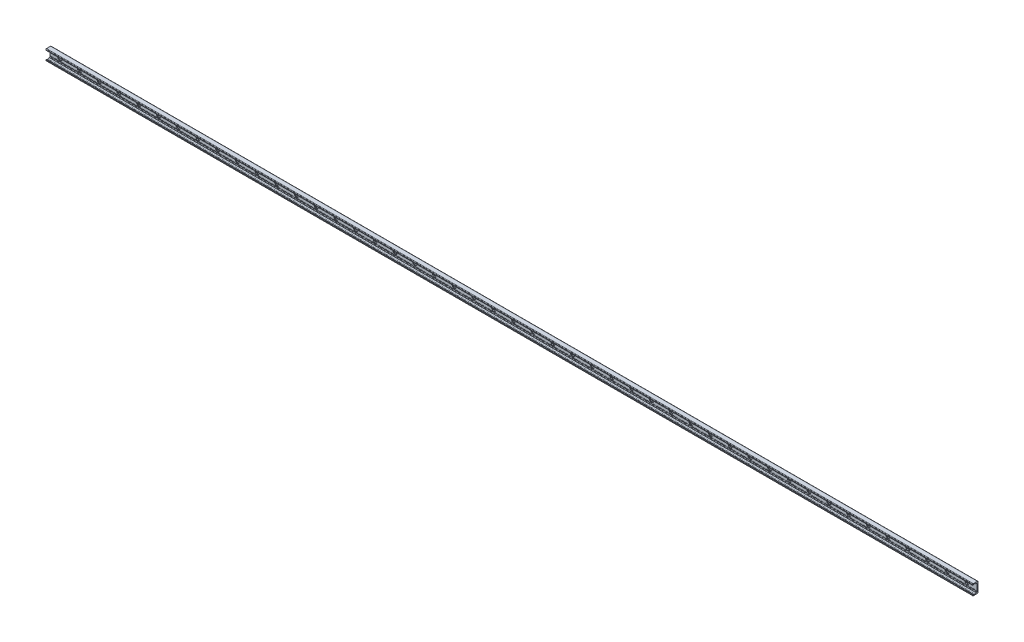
from build123d import *

# Parameters (mm, degrees)
BOSS_EXTRUDE1_DEPTH = 1880
SKETCH2_R           = 9
SKETCH2_R_2         = 4.5
CUT_EXTRUDE1_DEPTH  = 3.1
SKETCH2_2_R         = 4.5
CUT_EXTRUDE2_DEPTH  = 1881.195335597
LPATTERN1_COUNT     = 47
LPATTERN1_PITCH     = 80


with BuildPart() as part:
    # Sketch1 → Boss-Extrude1 (new, symmetric)
    with BuildSketch(Plane(origin=(0, 0, 0), x_dir=(0, 0, -1), z_dir=(1, 0, 0))):
        with BuildLine():
            Line((0, 0), (0, 19))
            ThreePointArc((0, 19), (-0.732233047, 20.767766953), (-2.5, 21.5))
            Line((-2.5, 21.5), (-19, 21.5))
            ThreePointArc((-19, 21.5), (-20.414213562, 20.914213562), (-21, 19.5))
            Line((-21, 19.5), (-21, 16.625057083))
            ThreePointArc((-21, 16.625057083), (-20.553251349, 15.888838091), (-19.693931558, 15.945160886))
            Line((-19.693931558, 15.945160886), (-16.794305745, 17.975500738))
            ThreePointArc((-16.794305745, 17.975500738), (-14.5, 18.69889256), (-12.205694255, 17.975500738))
            Line((-12.205694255, 17.975500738), (-8.829831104, 15.611695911))
            ThreePointArc((-8.829831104, 15.611695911), (-8.28408983, 15.342566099), (-7.682678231, 15.25))
            Line((-7.682678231, 15.25), (-6.5, 15.25))
            ThreePointArc((-6.5, 15.25), (-5.085786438, 14.664213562), (-4.5, 13.25))
            Line((-4.5, 13.25), (-4.5, -10.75))
            ThreePointArc((-4.5, -10.75), (-4.25, -11), (-4.5, -11.25))
            Line((-4.5, -11.25), (-4.5, -12.25))
            ThreePointArc((-4.5, -12.25), (-4.25, -12.5), (-4.5, -12.75))
            Line((-4.5, -12.75), (-4.5, -13.25))
            ThreePointArc((-4.5, -13.25), (-5.085786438, -14.664213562), (-6.5, -15.25))
            Line((-6.5, -15.25), (-7.682678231, -15.25))
            ThreePointArc((-7.682678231, -15.25), (-8.28408983, -15.342566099), (-8.829831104, -15.611695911))
            Line((-8.829831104, -15.611695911), (-12.205694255, -17.975500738))
            ThreePointArc((-12.205694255, -17.975500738), (-14.5, -18.69889256), (-16.794305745, -17.975500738))
            Line((-16.794305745, -17.975500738), (-19.693931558, -15.945160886))
            ThreePointArc((-19.693931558, -15.945160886), (-20.553251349, -15.888838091), (-21, -16.625057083))
            Line((-21, -16.625057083), (-21, -19.5))
            ThreePointArc((-21, -19.5), (-20.414213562, -20.914213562), (-19, -21.5))
            Line((-19, -21.5), (-2.5, -21.5))
            ThreePointArc((-2.5, -21.5), (-0.732233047, -20.767766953), (0, -19))
            Line((0, -19), (0, 0))
        make_face()
    extrude(amount=BOSS_EXTRUDE1_DEPTH, both=True)

    # Sketch2 → Cut-Extrude1 (cut)
    with BuildSketch(Plane.XY.offset(4.5)):
        with Locations((1840, 0)):
            Circle(SKETCH2_R)
        with Locations((1840, 0)):
            Circle(SKETCH2_R_2, mode=Mode.SUBTRACT)
    cut_extrude1 = extrude(amount=-CUT_EXTRUDE1_DEPTH, mode=Mode.SUBTRACT)

    # Sketch2_2 → Cut-Extrude2 (cut, through all)
    with BuildSketch(Plane.XY.offset(4.5)):
        with Locations((1840, 0)):
            Circle(SKETCH2_2_R)
    cut_extrude2 = extrude(amount=-CUT_EXTRUDE2_DEPTH, mode=Mode.SUBTRACT)

    # LPattern1: Cut-Extrude1, Cut-Extrude2 ×47
    with Locations(*[(-i * LPATTERN1_PITCH, 0, 0) for i in range(1, LPATTERN1_COUNT)]):
        add(cut_extrude1, mode=Mode.SUBTRACT)
        add(cut_extrude2, mode=Mode.SUBTRACT)


solid = part.part
